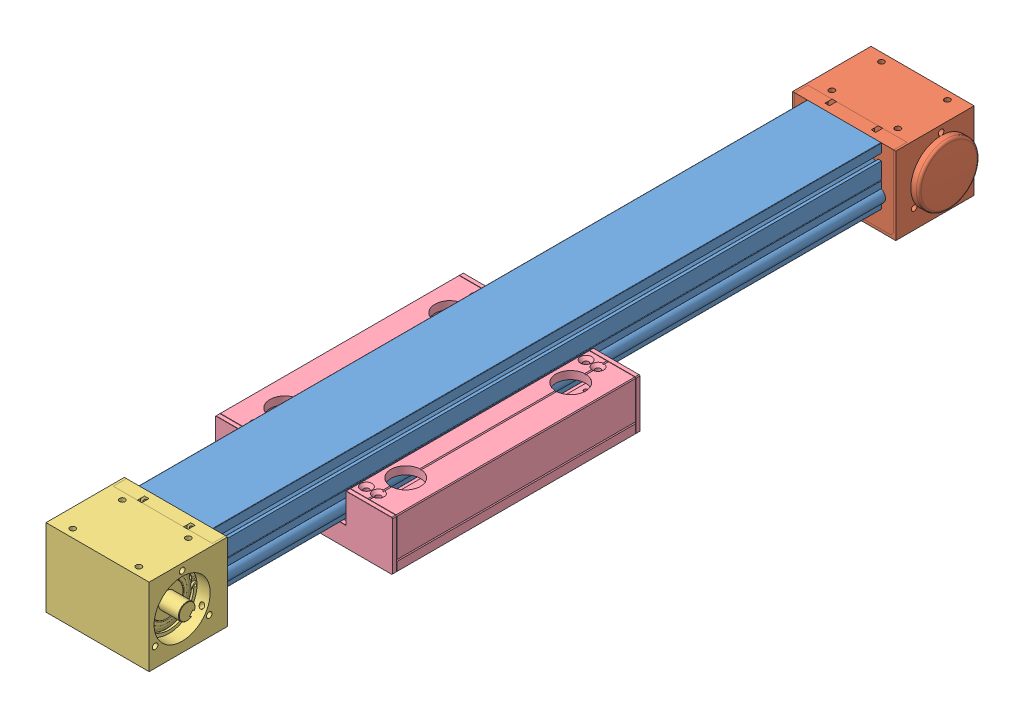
SolidWorks assembly MZK090_300_1000.SLDASM, configuration Standard (file format 12000). Lengths in mm.
Overall size (215 95 1000).
4 component instances, 4 part files, 8 mates.
Components (placement in the parent):
- Profil_MZ090-1: Profil_MZ090.SLDPRT [l=810] at origin size (100.1 81.5 810)
- Achskopf MZK090_ohne_Zapfen-1: Achskopf MZK090_ohne_Zapfen.SLDPRT [Standard] at (0 -13 -55) x (0 0 -1) z (-1 0 0) size (95 94 146.5)
- Achskopf MZK090_0-1: Achskopf MZK090_0.SLDPRT [Standard] at (0 -13 865) x (0 0 1) z (1 0 0) size (95 94 137)
- Schlitten_MZK090_300-1: Schlitten_MZK090_300.SLDPRT [Standard] at (0 35 505) x (-1 0 0) z (0 0 1) size (215 60 300)
Mates (geometry in assembly coordinates):
- Deckungsgleich1: coincident aligned: plane of Achskopf MZK090_ohne_Zapfen-1 through (-62.5 35 0) normal (0 1 0); plane of Profil_MZ090-1 through (-45 35 810) normal (0 1 0)
- Deckungsgleich2: coincident anti-aligned: plane of Profil_MZ090-1 through (-45 35 0) normal (0 0 -1); plane of Achskopf MZK090_ohne_Zapfen-1 through (54 -50 0) normal (0 0 1)
- Breite1: width anti-aligned: plane of Achskopf MZK090_ohne_Zapfen-1 through (-62.5 -59 0) normal (-1 0 0); plane of Achskopf MZK090_ohne_Zapfen-1 through (62.5 -59 0) normal (1 0 0); plane of Profil_MZ090-1 through (45 35 810) normal (1 0 0); plane of Profil_MZ090-1 through (-45 35 810) normal (-1 0 0)
- Deckungsgleich3: coincident aligned: plane of Achskopf MZK090_0-1 through (62.5 35 810) normal (0 1 0); plane of Profil_MZ090-1 through (-45 35 810) normal (0 1 0)
- Deckungsgleich4: coincident anti-aligned: plane of Achskopf MZK090_0-1 through (-54 -50 810) normal (0 0 -1); plane of Profil_MZ090-1 through (-45 35 810) normal (0 0 1)
- Breite2: width anti-aligned: plane of Achskopf MZK090_0-1 through (-62.5 -59 810) normal (-1 0 0); plane of Achskopf MZK090_0-1 through (62.5 -59 810) normal (1 0 0); plane of Profil_MZ090-1 through (45 35 810) normal (1 0 0); plane of Profil_MZ090-1 through (-45 35 810) normal (-1 0 0)
- Abstand1: distance = 95 mm anti-aligned: plane of Profil_MZ090-1 through (-45 35 810) normal (0 1 0); plane of Schlitten_MZK090_300-1 through (-107.5 -60 650) normal (0 -1 0)
- Breite3: width anti-aligned: plane of Schlitten_MZK090_300-1 through (-107.5 -60 650) normal (-1 0 0); plane of Schlitten_MZK090_300-1 through (107.5 -60 650) normal (1 0 0); plane of Profil_MZ090-1 through (45 35 810) normal (1 0 0); plane of Profil_MZ090-1 through (-45 35 810) normal (-1 0 0)
